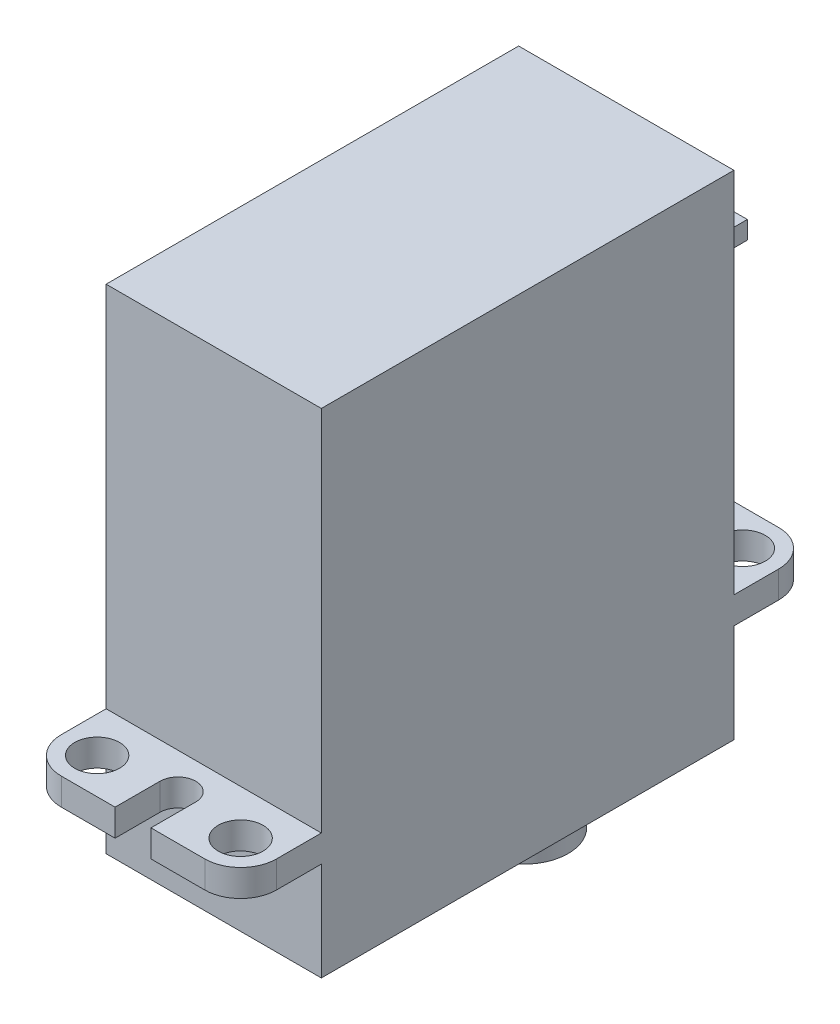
ISO-10303-21;
HEADER;
FILE_DESCRIPTION(('STEP AP214'),'2;1');
FILE_NAME('part.step','',(''),(''),'','','');
FILE_SCHEMA(('AUTOMOTIVE_DESIGN { 1 0 10303 214 1 1 1 1 }'));
ENDSEC;
DATA;
#1=APPLICATION_CONTEXT('core data for automotive mechanical design processes');
#2=APPLICATION_PROTOCOL_DEFINITION('international standard','automotive_design',2000,#1);
#3=PRODUCT_CONTEXT('',#1,'mechanical');
#4=PRODUCT('Part','Part','',(#3));
#5=PRODUCT_RELATED_PRODUCT_CATEGORY('part','',(#4));
#6=PRODUCT_DEFINITION_FORMATION('','',#4);
#7=PRODUCT_DEFINITION_CONTEXT('part definition',#1,'design');
#8=PRODUCT_DEFINITION('design','',#6,#7);
#9=PRODUCT_DEFINITION_SHAPE('','',#8);
#10=(LENGTH_UNIT() NAMED_UNIT(*) SI_UNIT(.MILLI.,.METRE.));
#11=(NAMED_UNIT(*) PLANE_ANGLE_UNIT() SI_UNIT($,.RADIAN.));
#12=(NAMED_UNIT(*) SI_UNIT($,.STERADIAN.) SOLID_ANGLE_UNIT());
#13=UNCERTAINTY_MEASURE_WITH_UNIT(LENGTH_MEASURE(1.E-05),#10,'distance_accuracy_value','');
#14=(GEOMETRIC_REPRESENTATION_CONTEXT(3) GLOBAL_UNCERTAINTY_ASSIGNED_CONTEXT((#13)) GLOBAL_UNIT_ASSIGNED_CONTEXT((#10,
#11,#12)) REPRESENTATION_CONTEXT('',''));
#15=CARTESIAN_POINT('',(0.,0.,0.));
#16=DIRECTION('',(0.,0.,1.));
#17=DIRECTION('',(1.,0.,0.));
#18=AXIS2_PLACEMENT_3D('',#15,#16,#17);
#19=CARTESIAN_POINT('',(0.,0.,5.79));
#20=DIRECTION('',(0.,1.,0.));
#21=DIRECTION('',(1.,0.,0.));
#22=AXIS2_PLACEMENT_3D('',#19,#20,#21);
#23=PLANE('',#22);
#24=CARTESIAN_POINT('',(-4.,0.,19.79));
#25=DIRECTION('',(0.,-1.,0.));
#26=DIRECTION('',(1.,0.,0.));
#27=AXIS2_PLACEMENT_3D('',#24,#25,#26);
#28=CIRCLE('',#27,1.25);
#29=CARTESIAN_POINT('',(-5.25,0.,19.79));
#30=VERTEX_POINT('',#29);
#31=EDGE_CURVE('E585',#30,#30,#28,.T.);
#32=ORIENTED_EDGE('',*,*,#31,.F.);
#33=EDGE_LOOP('',(#32));
#34=FACE_BOUND('',#33,.T.);
#35=CARTESIAN_POINT('',(4.,0.,19.79));
#36=DIRECTION('',(0.,-1.,0.));
#37=DIRECTION('',(1.,0.,0.));
#38=AXIS2_PLACEMENT_3D('',#35,#36,#37);
#39=CIRCLE('',#38,1.25);
#40=CARTESIAN_POINT('',(2.75,0.,19.79));
#41=VERTEX_POINT('',#40);
#42=EDGE_CURVE('E422',#41,#41,#39,.T.);
#43=ORIENTED_EDGE('',*,*,#42,.F.);
#44=EDGE_LOOP('',(#43));
#45=FACE_BOUND('',#44,.T.);
#46=CARTESIAN_POINT('',(-4.,0.,19.79));
#47=DIRECTION('',(0.,1.,0.));
#48=DIRECTION('',(-0.707106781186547,0.,0.707106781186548));
#49=AXIS2_PLACEMENT_3D('',#46,#47,#48);
#50=CIRCLE('',#49,2.);
#51=CARTESIAN_POINT('',(-6.,0.,19.79));
#52=VERTEX_POINT('',#51);
#53=CARTESIAN_POINT('',(-4.,0.,21.79));
#54=VERTEX_POINT('',#53);
#55=EDGE_CURVE('E338',#52,#54,#50,.T.);
#56=ORIENTED_EDGE('',*,*,#55,.F.);
#57=DIRECTION('',(0.,0.,1.));
#58=VECTOR('',#57,1.);
#59=CARTESIAN_POINT('',(-6.,0.,-5.71));
#60=LINE('',#59,#58);
#61=CARTESIAN_POINT('',(-6.,0.,17.29));
#62=VERTEX_POINT('',#61);
#63=EDGE_CURVE('E605',#62,#52,#60,.T.);
#64=ORIENTED_EDGE('',*,*,#63,.F.);
#65=DIRECTION('',(1.,0.,0.));
#66=VECTOR('',#65,1.);
#67=CARTESIAN_POINT('',(3.,0.,17.29));
#68=LINE('',#67,#66);
#69=CARTESIAN_POINT('',(6.,0.,17.29));
#70=VERTEX_POINT('',#69);
#71=EDGE_CURVE('E450',#62,#70,#68,.T.);
#72=ORIENTED_EDGE('',*,*,#71,.T.);
#73=DIRECTION('',(0.,0.,-1.));
#74=VECTOR('',#73,1.);
#75=CARTESIAN_POINT('',(6.,0.,21.79));
#76=LINE('',#75,#74);
#77=CARTESIAN_POINT('',(6.,0.,19.79));
#78=VERTEX_POINT('',#77);
#79=EDGE_CURVE('E402',#78,#70,#76,.T.);
#80=ORIENTED_EDGE('',*,*,#79,.F.);
#81=CARTESIAN_POINT('',(4.,0.,19.79));
#82=DIRECTION('',(0.,1.,0.));
#83=DIRECTION('',(0.707106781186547,0.,0.707106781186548));
#84=AXIS2_PLACEMENT_3D('',#81,#82,#83);
#85=CIRCLE('',#84,2.);
#86=CARTESIAN_POINT('',(4.,0.,21.79));
#87=VERTEX_POINT('',#86);
#88=EDGE_CURVE('E474',#87,#78,#85,.T.);
#89=ORIENTED_EDGE('',*,*,#88,.F.);
#90=DIRECTION('',(-1.,0.,0.));
#91=VECTOR('',#90,1.);
#92=CARTESIAN_POINT('',(6.,0.,21.79));
#93=LINE('',#92,#91);
#94=CARTESIAN_POINT('',(1.,0.,21.79));
#95=VERTEX_POINT('',#94);
#96=EDGE_CURVE('E440',#87,#95,#93,.T.);
#97=ORIENTED_EDGE('',*,*,#96,.T.);
#98=DIRECTION('',(0.,0.,-1.));
#99=VECTOR('',#98,1.);
#100=CARTESIAN_POINT('',(1.,0.,21.79));
#101=LINE('',#100,#99);
#102=CARTESIAN_POINT('',(1.,0.,19.29));
#103=VERTEX_POINT('',#102);
#104=EDGE_CURVE('E565',#95,#103,#101,.T.);
#105=ORIENTED_EDGE('',*,*,#104,.T.);
#106=CARTESIAN_POINT('',(0.,0.,19.29));
#107=DIRECTION('',(0.,1.,0.));
#108=DIRECTION('',(1.,0.,0.));
#109=AXIS2_PLACEMENT_3D('',#106,#107,#108);
#110=CIRCLE('',#109,1.);
#111=CARTESIAN_POINT('',(-1.,0.,19.29));
#112=VERTEX_POINT('',#111);
#113=EDGE_CURVE('E509',#103,#112,#110,.T.);
#114=ORIENTED_EDGE('',*,*,#113,.T.);
#115=DIRECTION('',(0.,0.,-1.));
#116=VECTOR('',#115,1.);
#117=CARTESIAN_POINT('',(-1.,0.,21.79));
#118=LINE('',#117,#116);
#119=CARTESIAN_POINT('',(-1.,0.,21.79));
#120=VERTEX_POINT('',#119);
#121=EDGE_CURVE('E345',#120,#112,#118,.T.);
#122=ORIENTED_EDGE('',*,*,#121,.F.);
#123=DIRECTION('',(-1.,0.,0.));
#124=VECTOR('',#123,1.);
#125=CARTESIAN_POINT('',(6.,0.,21.79));
#126=LINE('',#125,#124);
#127=EDGE_CURVE('E11',#120,#54,#126,.T.);
#128=ORIENTED_EDGE('',*,*,#127,.T.);
#129=EDGE_LOOP('',(#56,#64,#72,#80,#89,#97,#105,#114,#122,#128));
#130=FACE_BOUND('',#129,.T.);
#131=ADVANCED_FACE('F16',(#34,#45,#130),#23,.F.);
#132=CARTESIAN_POINT('',(-6.,0.,21.79));
#133=DIRECTION('',(0.,0.,1.));
#134=DIRECTION('',(1.,0.,0.));
#135=AXIS2_PLACEMENT_3D('',#132,#133,#134);
#136=PLANE('',#135);
#137=DIRECTION('',(0.,1.,0.));
#138=VECTOR('',#137,1.);
#139=CARTESIAN_POINT('',(-4.,0.,21.79));
#140=LINE('',#139,#138);
#141=CARTESIAN_POINT('',(-4.,1.5,21.79));
#142=VERTEX_POINT('',#141);
#143=EDGE_CURVE('E342',#54,#142,#140,.T.);
#144=ORIENTED_EDGE('',*,*,#143,.F.);
#145=ORIENTED_EDGE('',*,*,#127,.F.);
#146=DIRECTION('',(0.,1.,0.));
#147=VECTOR('',#146,1.);
#148=CARTESIAN_POINT('',(-1.,0.,21.79));
#149=LINE('',#148,#147);
#150=CARTESIAN_POINT('',(-1.,1.5,21.79));
#151=VERTEX_POINT('',#150);
#152=EDGE_CURVE('E30',#120,#151,#149,.T.);
#153=ORIENTED_EDGE('',*,*,#152,.T.);
#154=DIRECTION('',(1.,0.,0.));
#155=VECTOR('',#154,1.);
#156=CARTESIAN_POINT('',(6.,1.5,21.79));
#157=LINE('',#156,#155);
#158=EDGE_CURVE('E346',#142,#151,#157,.T.);
#159=ORIENTED_EDGE('',*,*,#158,.F.);
#160=EDGE_LOOP('',(#144,#145,#153,#159));
#161=FACE_BOUND('',#160,.T.);
#162=ADVANCED_FACE('F344',(#161),#136,.T.);
#163=CARTESIAN_POINT('',(-1.,0.,21.79));
#164=DIRECTION('',(1.,0.,0.));
#165=DIRECTION('',(0.,1.,0.));
#166=AXIS2_PLACEMENT_3D('',#163,#164,#165);
#167=PLANE('',#166);
#168=ORIENTED_EDGE('',*,*,#121,.T.);
#169=DIRECTION('',(0.,1.,0.));
#170=VECTOR('',#169,1.);
#171=CARTESIAN_POINT('',(-1.,0.,19.29));
#172=LINE('',#171,#170);
#173=CARTESIAN_POINT('',(-1.,1.5,19.29));
#174=VERTEX_POINT('',#173);
#175=EDGE_CURVE('E398',#112,#174,#172,.T.);
#176=ORIENTED_EDGE('',*,*,#175,.T.);
#177=DIRECTION('',(0.,0.,-1.));
#178=VECTOR('',#177,1.);
#179=CARTESIAN_POINT('',(-1.,1.5,21.79));
#180=LINE('',#179,#178);
#181=EDGE_CURVE('E405',#151,#174,#180,.T.);
#182=ORIENTED_EDGE('',*,*,#181,.F.);
#183=ORIENTED_EDGE('',*,*,#152,.F.);
#184=EDGE_LOOP('',(#168,#176,#182,#183));
#185=FACE_BOUND('',#184,.T.);
#186=ADVANCED_FACE('F903',(#185),#167,.T.);
#187=CARTESIAN_POINT('',(0.,0.,19.29));
#188=DIRECTION('',(0.,1.,0.));
#189=DIRECTION('',(1.,0.,0.));
#190=AXIS2_PLACEMENT_3D('',#187,#188,#189);
#191=CYLINDRICAL_SURFACE('',#190,1.);
#192=ORIENTED_EDGE('',*,*,#113,.F.);
#193=DIRECTION('',(0.,1.,0.));
#194=VECTOR('',#193,1.);
#195=CARTESIAN_POINT('',(1.,0.,19.29));
#196=LINE('',#195,#194);
#197=CARTESIAN_POINT('',(1.,1.5,19.29));
#198=VERTEX_POINT('',#197);
#199=EDGE_CURVE('E513',#103,#198,#196,.T.);
#200=ORIENTED_EDGE('',*,*,#199,.T.);
#201=CARTESIAN_POINT('',(0.,1.5,19.29));
#202=DIRECTION('',(0.,-1.,0.));
#203=DIRECTION('',(1.,0.,0.));
#204=AXIS2_PLACEMENT_3D('',#201,#202,#203);
#205=CIRCLE('',#204,1.);
#206=EDGE_CURVE('E523',#174,#198,#205,.T.);
#207=ORIENTED_EDGE('',*,*,#206,.F.);
#208=ORIENTED_EDGE('',*,*,#175,.F.);
#209=EDGE_LOOP('',(#192,#200,#207,#208));
#210=FACE_BOUND('',#209,.T.);
#211=ADVANCED_FACE('F1181',(#210),#191,.F.);
#212=CARTESIAN_POINT('',(1.,0.,19.29));
#213=DIRECTION('',(-1.,0.,0.));
#214=DIRECTION('',(0.,0.,1.));
#215=AXIS2_PLACEMENT_3D('',#212,#213,#214);
#216=PLANE('',#215);
#217=ORIENTED_EDGE('',*,*,#104,.F.);
#218=DIRECTION('',(0.,1.,0.));
#219=VECTOR('',#218,1.);
#220=CARTESIAN_POINT('',(1.,0.,21.79));
#221=LINE('',#220,#219);
#222=CARTESIAN_POINT('',(1.,1.5,21.79));
#223=VERTEX_POINT('',#222);
#224=EDGE_CURVE('E432',#95,#223,#221,.T.);
#225=ORIENTED_EDGE('',*,*,#224,.T.);
#226=DIRECTION('',(0.,0.,1.));
#227=VECTOR('',#226,1.);
#228=CARTESIAN_POINT('',(1.,1.5,21.79));
#229=LINE('',#228,#227);
#230=EDGE_CURVE('E572',#198,#223,#229,.T.);
#231=ORIENTED_EDGE('',*,*,#230,.F.);
#232=ORIENTED_EDGE('',*,*,#199,.F.);
#233=EDGE_LOOP('',(#217,#225,#231,#232));
#234=FACE_BOUND('',#233,.T.);
#235=ADVANCED_FACE('F870',(#234),#216,.T.);
#236=CARTESIAN_POINT('',(6.,0.,21.79));
#237=DIRECTION('',(1.,0.,0.));
#238=DIRECTION('',(0.,1.,0.));
#239=AXIS2_PLACEMENT_3D('',#236,#237,#238);
#240=PLANE('',#239);
#241=DIRECTION('',(0.,-1.,0.));
#242=VECTOR('',#241,1.);
#243=CARTESIAN_POINT('',(6.,0.,-8.21));
#244=LINE('',#243,#242);
#245=CARTESIAN_POINT('',(6.,1.5,-8.21));
#246=VERTEX_POINT('',#245);
#247=CARTESIAN_POINT('',(6.,0.,-8.21));
#248=VERTEX_POINT('',#247);
#249=EDGE_CURVE('E533',#246,#248,#244,.T.);
#250=ORIENTED_EDGE('',*,*,#249,.F.);
#251=DIRECTION('',(0.,0.,-1.));
#252=VECTOR('',#251,1.);
#253=CARTESIAN_POINT('',(6.,1.5,21.79));
#254=LINE('',#253,#252);
#255=CARTESIAN_POINT('',(6.,1.5,-5.71));
#256=VERTEX_POINT('',#255);
#257=EDGE_CURVE('E393',#256,#246,#254,.T.);
#258=ORIENTED_EDGE('',*,*,#257,.F.);
#259=DIRECTION('',(0.,1.,0.));
#260=VECTOR('',#259,1.);
#261=CARTESIAN_POINT('',(6.,0.,-5.71));
#262=LINE('',#261,#260);
#263=CARTESIAN_POINT('',(6.,22.,-5.71));
#264=VERTEX_POINT('',#263);
#265=EDGE_CURVE('E433',#256,#264,#262,.T.);
#266=ORIENTED_EDGE('',*,*,#265,.T.);
#267=DIRECTION('',(0.,0.,-1.));
#268=VECTOR('',#267,1.);
#269=CARTESIAN_POINT('',(6.,22.,17.29));
#270=LINE('',#269,#268);
#271=CARTESIAN_POINT('',(6.,22.,17.29));
#272=VERTEX_POINT('',#271);
#273=EDGE_CURVE('E496',#272,#264,#270,.T.);
#274=ORIENTED_EDGE('',*,*,#273,.F.);
#275=DIRECTION('',(0.,1.,0.));
#276=VECTOR('',#275,1.);
#277=CARTESIAN_POINT('',(6.,0.,17.29));
#278=LINE('',#277,#276);
#279=CARTESIAN_POINT('',(6.,1.5,17.29));
#280=VERTEX_POINT('',#279);
#281=EDGE_CURVE('E395',#280,#272,#278,.T.);
#282=ORIENTED_EDGE('',*,*,#281,.F.);
#283=DIRECTION('',(0.,0.,-1.));
#284=VECTOR('',#283,1.);
#285=CARTESIAN_POINT('',(6.,1.5,21.79));
#286=LINE('',#285,#284);
#287=CARTESIAN_POINT('',(6.,1.5,19.79));
#288=VERTEX_POINT('',#287);
#289=EDGE_CURVE('E374',#288,#280,#286,.T.);
#290=ORIENTED_EDGE('',*,*,#289,.F.);
#291=DIRECTION('',(0.,1.,0.));
#292=VECTOR('',#291,1.);
#293=CARTESIAN_POINT('',(6.,0.,19.79));
#294=LINE('',#293,#292);
#295=EDGE_CURVE('E437',#78,#288,#294,.T.);
#296=ORIENTED_EDGE('',*,*,#295,.F.);
#297=ORIENTED_EDGE('',*,*,#79,.T.);
#298=DIRECTION('',(0.,1.,0.));
#299=VECTOR('',#298,1.);
#300=CARTESIAN_POINT('',(6.,0.,17.29));
#301=LINE('',#300,#299);
#302=CARTESIAN_POINT('',(6.,-5.5,17.29));
#303=VERTEX_POINT('',#302);
#304=EDGE_CURVE('E677',#303,#70,#301,.T.);
#305=ORIENTED_EDGE('',*,*,#304,.F.);
#306=DIRECTION('',(0.,0.,1.));
#307=VECTOR('',#306,1.);
#308=CARTESIAN_POINT('',(6.,-5.5,17.29));
#309=LINE('',#308,#307);
#310=CARTESIAN_POINT('',(6.,-5.5,-5.71));
#311=VERTEX_POINT('',#310);
#312=EDGE_CURVE('E391',#311,#303,#309,.T.);
#313=ORIENTED_EDGE('',*,*,#312,.F.);
#314=DIRECTION('',(0.,1.,0.));
#315=VECTOR('',#314,1.);
#316=CARTESIAN_POINT('',(6.,0.,-5.71));
#317=LINE('',#316,#315);
#318=CARTESIAN_POINT('',(6.,0.,-5.71));
#319=VERTEX_POINT('',#318);
#320=EDGE_CURVE('E617',#311,#319,#317,.T.);
#321=ORIENTED_EDGE('',*,*,#320,.T.);
#322=DIRECTION('',(0.,0.,-1.));
#323=VECTOR('',#322,1.);
#324=CARTESIAN_POINT('',(6.,0.,21.79));
#325=LINE('',#324,#323);
#326=EDGE_CURVE('E632',#319,#248,#325,.T.);
#327=ORIENTED_EDGE('',*,*,#326,.T.);
#328=EDGE_LOOP('',(#250,#258,#266,#274,#282,#290,#296,#297,#305,#313,#321,#327));
#329=FACE_BOUND('',#328,.T.);
#330=ADVANCED_FACE('F865',(#329),#240,.T.);
#331=CARTESIAN_POINT('',(1.,0.,-10.21));
#332=DIRECTION('',(-1.,0.,0.));
#333=DIRECTION('',(0.,0.,1.));
#334=AXIS2_PLACEMENT_3D('',#331,#332,#333);
#335=PLANE('',#334);
#336=DIRECTION('',(0.,0.,1.));
#337=VECTOR('',#336,1.);
#338=CARTESIAN_POINT('',(1.,0.,-10.21));
#339=LINE('',#338,#337);
#340=CARTESIAN_POINT('',(1.,0.,-10.21));
#341=VERTEX_POINT('',#340);
#342=CARTESIAN_POINT('',(1.,0.,-7.71));
#343=VERTEX_POINT('',#342);
#344=EDGE_CURVE('E506',#341,#343,#339,.T.);
#345=ORIENTED_EDGE('',*,*,#344,.T.);
#346=DIRECTION('',(0.,1.,0.));
#347=VECTOR('',#346,1.);
#348=CARTESIAN_POINT('',(1.,0.,-7.71));
#349=LINE('',#348,#347);
#350=CARTESIAN_POINT('',(1.,1.5,-7.71));
#351=VERTEX_POINT('',#350);
#352=EDGE_CURVE('E401',#343,#351,#349,.T.);
#353=ORIENTED_EDGE('',*,*,#352,.T.);
#354=DIRECTION('',(0.,0.,1.));
#355=VECTOR('',#354,1.);
#356=CARTESIAN_POINT('',(1.,1.5,-10.21));
#357=LINE('',#356,#355);
#358=CARTESIAN_POINT('',(1.,1.5,-10.21));
#359=VERTEX_POINT('',#358);
#360=EDGE_CURVE('E624',#359,#351,#357,.T.);
#361=ORIENTED_EDGE('',*,*,#360,.F.);
#362=DIRECTION('',(0.,1.,0.));
#363=VECTOR('',#362,1.);
#364=CARTESIAN_POINT('',(1.,0.,-10.21));
#365=LINE('',#364,#363);
#366=EDGE_CURVE('E306',#341,#359,#365,.T.);
#367=ORIENTED_EDGE('',*,*,#366,.F.);
#368=EDGE_LOOP('',(#345,#353,#361,#367));
#369=FACE_BOUND('',#368,.T.);
#370=ADVANCED_FACE('F866',(#369),#335,.T.);
#371=CARTESIAN_POINT('',(0.,0.,-7.71));
#372=DIRECTION('',(0.,1.,0.));
#373=DIRECTION('',(1.,0.,0.));
#374=AXIS2_PLACEMENT_3D('',#371,#372,#373);
#375=CYLINDRICAL_SURFACE('',#374,1.);
#376=CARTESIAN_POINT('',(0.,0.,-7.71));
#377=DIRECTION('',(0.,1.,0.));
#378=DIRECTION('',(1.,0.,0.));
#379=AXIS2_PLACEMENT_3D('',#376,#377,#378);
#380=CIRCLE('',#379,1.);
#381=CARTESIAN_POINT('',(-1.,0.,-7.71));
#382=VERTEX_POINT('',#381);
#383=EDGE_CURVE('E502',#382,#343,#380,.T.);
#384=ORIENTED_EDGE('',*,*,#383,.F.);
#385=DIRECTION('',(0.,1.,0.));
#386=VECTOR('',#385,1.);
#387=CARTESIAN_POINT('',(-1.,0.,-7.71));
#388=LINE('',#387,#386);
#389=CARTESIAN_POINT('',(-1.,1.5,-7.71));
#390=VERTEX_POINT('',#389);
#391=EDGE_CURVE('E404',#382,#390,#388,.T.);
#392=ORIENTED_EDGE('',*,*,#391,.T.);
#393=CARTESIAN_POINT('',(0.,1.5,-7.71));
#394=DIRECTION('',(0.,-1.,0.));
#395=DIRECTION('',(1.,0.,0.));
#396=AXIS2_PLACEMENT_3D('',#393,#394,#395);
#397=CIRCLE('',#396,1.);
#398=EDGE_CURVE('E619',#351,#390,#397,.T.);
#399=ORIENTED_EDGE('',*,*,#398,.F.);
#400=ORIENTED_EDGE('',*,*,#352,.F.);
#401=EDGE_LOOP('',(#384,#392,#399,#400));
#402=FACE_BOUND('',#401,.T.);
#403=ADVANCED_FACE('F1353',(#402),#375,.F.);
#404=CARTESIAN_POINT('',(-1.,0.,-7.71));
#405=DIRECTION('',(1.,0.,0.));
#406=DIRECTION('',(0.,0.,1.));
#407=AXIS2_PLACEMENT_3D('',#404,#405,#406);
#408=PLANE('',#407);
#409=DIRECTION('',(0.,0.,1.));
#410=VECTOR('',#409,1.);
#411=CARTESIAN_POINT('',(-1.,0.,-10.21));
#412=LINE('',#411,#410);
#413=CARTESIAN_POINT('',(-1.,0.,-10.21));
#414=VERTEX_POINT('',#413);
#415=EDGE_CURVE('E510',#414,#382,#412,.T.);
#416=ORIENTED_EDGE('',*,*,#415,.F.);
#417=DIRECTION('',(0.,1.,0.));
#418=VECTOR('',#417,1.);
#419=CARTESIAN_POINT('',(-1.,0.,-10.21));
#420=LINE('',#419,#418);
#421=CARTESIAN_POINT('',(-1.,1.5,-10.21));
#422=VERTEX_POINT('',#421);
#423=EDGE_CURVE('E541',#414,#422,#420,.T.);
#424=ORIENTED_EDGE('',*,*,#423,.T.);
#425=DIRECTION('',(0.,0.,-1.));
#426=VECTOR('',#425,1.);
#427=CARTESIAN_POINT('',(-1.,1.5,-10.21));
#428=LINE('',#427,#426);
#429=EDGE_CURVE('E622',#390,#422,#428,.T.);
#430=ORIENTED_EDGE('',*,*,#429,.F.);
#431=ORIENTED_EDGE('',*,*,#391,.F.);
#432=EDGE_LOOP('',(#416,#424,#430,#431));
#433=FACE_BOUND('',#432,.T.);
#434=ADVANCED_FACE('F934',(#433),#408,.T.);
#435=CARTESIAN_POINT('',(-1.,0.,-10.21));
#436=DIRECTION('',(0.,0.,-1.));
#437=DIRECTION('',(0.,-1.,0.));
#438=AXIS2_PLACEMENT_3D('',#435,#436,#437);
#439=PLANE('',#438);
#440=DIRECTION('',(0.,-1.,0.));
#441=VECTOR('',#440,1.);
#442=CARTESIAN_POINT('',(-4.,0.,-10.21));
#443=LINE('',#442,#441);
#444=CARTESIAN_POINT('',(-4.,1.5,-10.21));
#445=VERTEX_POINT('',#444);
#446=CARTESIAN_POINT('',(-4.,0.,-10.21));
#447=VERTEX_POINT('',#446);
#448=EDGE_CURVE('E420',#445,#447,#443,.T.);
#449=ORIENTED_EDGE('',*,*,#448,.F.);
#450=DIRECTION('',(-1.,0.,0.));
#451=VECTOR('',#450,1.);
#452=CARTESIAN_POINT('',(-6.,1.5,-10.21));
#453=LINE('',#452,#451);
#454=EDGE_CURVE('E580',#422,#445,#453,.T.);
#455=ORIENTED_EDGE('',*,*,#454,.F.);
#456=ORIENTED_EDGE('',*,*,#423,.F.);
#457=DIRECTION('',(1.,0.,0.));
#458=VECTOR('',#457,1.);
#459=CARTESIAN_POINT('',(-6.,0.,-10.21));
#460=LINE('',#459,#458);
#461=EDGE_CURVE('E552',#447,#414,#460,.T.);
#462=ORIENTED_EDGE('',*,*,#461,.F.);
#463=EDGE_LOOP('',(#449,#455,#456,#462));
#464=FACE_BOUND('',#463,.T.);
#465=ADVANCED_FACE('F931',(#464),#439,.T.);
#466=CARTESIAN_POINT('',(4.,0.,-8.21));
#467=DIRECTION('',(0.,1.,0.));
#468=DIRECTION('',(1.,0.,0.));
#469=AXIS2_PLACEMENT_3D('',#466,#467,#468);
#470=CYLINDRICAL_SURFACE('',#469,1.25);
#471=CARTESIAN_POINT('',(4.,1.5,-8.21));
#472=DIRECTION('',(0.,-1.,0.));
#473=DIRECTION('',(1.,0.,0.));
#474=AXIS2_PLACEMENT_3D('',#471,#472,#473);
#475=CIRCLE('',#474,1.25);
#476=CARTESIAN_POINT('',(2.75,1.5,-8.21));
#477=VERTEX_POINT('',#476);
#478=EDGE_CURVE('E499',#477,#477,#475,.T.);
#479=ORIENTED_EDGE('',*,*,#478,.F.);
#480=DIRECTION('',(0.,-1.,0.));
#481=VECTOR('',#480,1.);
#482=CARTESIAN_POINT('',(2.75,0.,-8.21));
#483=LINE('',#482,#481);
#484=CARTESIAN_POINT('',(2.75,0.,-8.21));
#485=VERTEX_POINT('',#484);
#486=EDGE_CURVE('E428',#477,#485,#483,.T.);
#487=ORIENTED_EDGE('',*,*,#486,.T.);
#488=CARTESIAN_POINT('',(4.,0.,-8.21));
#489=DIRECTION('',(0.,-1.,0.));
#490=DIRECTION('',(1.,0.,0.));
#491=AXIS2_PLACEMENT_3D('',#488,#489,#490);
#492=CIRCLE('',#491,1.25);
#493=EDGE_CURVE('E410',#485,#485,#492,.T.);
#494=ORIENTED_EDGE('',*,*,#493,.T.);
#495=ORIENTED_EDGE('',*,*,#486,.F.);
#496=EDGE_LOOP('',(#479,#487,#494,#495));
#497=FACE_BOUND('',#496,.T.);
#498=ADVANCED_FACE('F933',(#497),#470,.F.);
#499=CARTESIAN_POINT('',(4.,0.,19.79));
#500=DIRECTION('',(0.,1.,0.));
#501=DIRECTION('',(1.,0.,0.));
#502=AXIS2_PLACEMENT_3D('',#499,#500,#501);
#503=CYLINDRICAL_SURFACE('',#502,1.25);
#504=CARTESIAN_POINT('',(4.,1.5,19.79));
#505=DIRECTION('',(0.,-1.,0.));
#506=DIRECTION('',(1.,0.,0.));
#507=AXIS2_PLACEMENT_3D('',#504,#505,#506);
#508=CIRCLE('',#507,1.25);
#509=CARTESIAN_POINT('',(2.75,1.5,19.79));
#510=VERTEX_POINT('',#509);
#511=EDGE_CURVE('E369',#510,#510,#508,.T.);
#512=ORIENTED_EDGE('',*,*,#511,.F.);
#513=DIRECTION('',(0.,-1.,0.));
#514=VECTOR('',#513,1.);
#515=CARTESIAN_POINT('',(2.75,0.,19.79));
#516=LINE('',#515,#514);
#517=EDGE_CURVE('E427',#510,#41,#516,.T.);
#518=ORIENTED_EDGE('',*,*,#517,.T.);
#519=ORIENTED_EDGE('',*,*,#42,.T.);
#520=ORIENTED_EDGE('',*,*,#517,.F.);
#521=EDGE_LOOP('',(#512,#518,#519,#520));
#522=FACE_BOUND('',#521,.T.);
#523=ADVANCED_FACE('F894',(#522),#503,.F.);
#524=CARTESIAN_POINT('',(-4.,0.,19.79));
#525=DIRECTION('',(0.,1.,0.));
#526=DIRECTION('',(1.,0.,0.));
#527=AXIS2_PLACEMENT_3D('',#524,#525,#526);
#528=CYLINDRICAL_SURFACE('',#527,1.25);
#529=CARTESIAN_POINT('',(-4.,1.5,19.79));
#530=DIRECTION('',(0.,-1.,0.));
#531=DIRECTION('',(1.,0.,0.));
#532=AXIS2_PLACEMENT_3D('',#529,#530,#531);
#533=CIRCLE('',#532,1.25);
#534=CARTESIAN_POINT('',(-5.25,1.5,19.79));
#535=VERTEX_POINT('',#534);
#536=EDGE_CURVE('E388',#535,#535,#533,.T.);
#537=ORIENTED_EDGE('',*,*,#536,.F.);
#538=DIRECTION('',(0.,-1.,0.));
#539=VECTOR('',#538,1.);
#540=CARTESIAN_POINT('',(-5.25,0.,19.79));
#541=LINE('',#540,#539);
#542=EDGE_CURVE('E20',#535,#30,#541,.T.);
#543=ORIENTED_EDGE('',*,*,#542,.T.);
#544=ORIENTED_EDGE('',*,*,#31,.T.);
#545=ORIENTED_EDGE('',*,*,#542,.F.);
#546=EDGE_LOOP('',(#537,#543,#544,#545));
#547=FACE_BOUND('',#546,.T.);
#548=ADVANCED_FACE('F886',(#547),#528,.F.);
#549=CARTESIAN_POINT('',(-4.,0.,-8.21));
#550=DIRECTION('',(0.,1.,0.));
#551=DIRECTION('',(1.,0.,0.));
#552=AXIS2_PLACEMENT_3D('',#549,#550,#551);
#553=CYLINDRICAL_SURFACE('',#552,1.25);
#554=CARTESIAN_POINT('',(-4.,1.5,-8.21));
#555=DIRECTION('',(0.,-1.,0.));
#556=DIRECTION('',(1.,0.,0.));
#557=AXIS2_PLACEMENT_3D('',#554,#555,#556);
#558=CIRCLE('',#557,1.25);
#559=CARTESIAN_POINT('',(-5.25,1.5,-8.21));
#560=VERTEX_POINT('',#559);
#561=EDGE_CURVE('E492',#560,#560,#558,.T.);
#562=ORIENTED_EDGE('',*,*,#561,.F.);
#563=DIRECTION('',(0.,-1.,0.));
#564=VECTOR('',#563,1.);
#565=CARTESIAN_POINT('',(-5.25,0.,-8.21));
#566=LINE('',#565,#564);
#567=CARTESIAN_POINT('',(-5.25,0.,-8.21));
#568=VERTEX_POINT('',#567);
#569=EDGE_CURVE('E500',#560,#568,#566,.T.);
#570=ORIENTED_EDGE('',*,*,#569,.T.);
#571=CARTESIAN_POINT('',(-4.,0.,-8.21));
#572=DIRECTION('',(0.,-1.,0.));
#573=DIRECTION('',(1.,0.,0.));
#574=AXIS2_PLACEMENT_3D('',#571,#572,#573);
#575=CIRCLE('',#574,1.25);
#576=EDGE_CURVE('E411',#568,#568,#575,.T.);
#577=ORIENTED_EDGE('',*,*,#576,.T.);
#578=ORIENTED_EDGE('',*,*,#569,.F.);
#579=EDGE_LOOP('',(#562,#570,#577,#578));
#580=FACE_BOUND('',#579,.T.);
#581=ADVANCED_FACE('F885',(#580),#553,.F.);
#582=CARTESIAN_POINT('',(0.,1.5,5.79));
#583=DIRECTION('',(0.,1.,0.));
#584=DIRECTION('',(1.,0.,0.));
#585=AXIS2_PLACEMENT_3D('',#582,#583,#584);
#586=PLANE('',#585);
#587=ORIENTED_EDGE('',*,*,#561,.T.);
#588=EDGE_LOOP('',(#587));
#589=FACE_BOUND('',#588,.T.);
#590=ORIENTED_EDGE('',*,*,#478,.T.);
#591=EDGE_LOOP('',(#590));
#592=FACE_BOUND('',#591,.T.);
#593=CARTESIAN_POINT('',(-4.,1.5,-8.21));
#594=DIRECTION('',(0.,-1.,0.));
#595=DIRECTION('',(-0.707106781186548,0.,-0.707106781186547));
#596=AXIS2_PLACEMENT_3D('',#593,#594,#595);
#597=CIRCLE('',#596,2.);
#598=CARTESIAN_POINT('',(-6.,1.5,-8.21));
#599=VERTEX_POINT('',#598);
#600=EDGE_CURVE('E424',#599,#445,#597,.T.);
#601=ORIENTED_EDGE('',*,*,#600,.F.);
#602=DIRECTION('',(0.,0.,1.));
#603=VECTOR('',#602,1.);
#604=CARTESIAN_POINT('',(-6.,1.5,-5.71));
#605=LINE('',#604,#603);
#606=CARTESIAN_POINT('',(-6.,1.5,-5.71));
#607=VERTEX_POINT('',#606);
#608=EDGE_CURVE('E548',#599,#607,#605,.T.);
#609=ORIENTED_EDGE('',*,*,#608,.T.);
#610=DIRECTION('',(1.,0.,0.));
#611=VECTOR('',#610,1.);
#612=CARTESIAN_POINT('',(-3.,1.5,-5.71));
#613=LINE('',#612,#611);
#614=EDGE_CURVE('E512',#607,#256,#613,.T.);
#615=ORIENTED_EDGE('',*,*,#614,.T.);
#616=ORIENTED_EDGE('',*,*,#257,.T.);
#617=CARTESIAN_POINT('',(4.,1.5,-8.21));
#618=DIRECTION('',(0.,-1.,0.));
#619=DIRECTION('',(0.707106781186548,0.,-0.707106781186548));
#620=AXIS2_PLACEMENT_3D('',#617,#618,#619);
#621=CIRCLE('',#620,2.);
#622=CARTESIAN_POINT('',(4.,1.5,-10.21));
#623=VERTEX_POINT('',#622);
#624=EDGE_CURVE('E534',#623,#246,#621,.T.);
#625=ORIENTED_EDGE('',*,*,#624,.F.);
#626=DIRECTION('',(-1.,0.,0.));
#627=VECTOR('',#626,1.);
#628=CARTESIAN_POINT('',(-6.,1.5,-10.21));
#629=LINE('',#628,#627);
#630=EDGE_CURVE('E364',#623,#359,#629,.T.);
#631=ORIENTED_EDGE('',*,*,#630,.T.);
#632=ORIENTED_EDGE('',*,*,#360,.T.);
#633=ORIENTED_EDGE('',*,*,#398,.T.);
#634=ORIENTED_EDGE('',*,*,#429,.T.);
#635=ORIENTED_EDGE('',*,*,#454,.T.);
#636=EDGE_LOOP('',(#601,#609,#615,#616,#625,#631,#632,#633,#634,#635));
#637=FACE_BOUND('',#636,.T.);
#638=ADVANCED_FACE('F813',(#589,#592,#637),#586,.T.);
#639=CARTESIAN_POINT('',(0.,-5.5,5.79));
#640=DIRECTION('',(0.,1.,0.));
#641=DIRECTION('',(1.,0.,0.));
#642=AXIS2_PLACEMENT_3D('',#639,#640,#641);
#643=PLANE('',#642);
#644=CARTESIAN_POINT('',(0.,-5.5,0.));
#645=DIRECTION('',(0.,1.,0.));
#646=DIRECTION('',(1.,0.,0.));
#647=AXIS2_PLACEMENT_3D('',#644,#645,#646);
#648=CIRCLE('',#647,4.5);
#649=CARTESIAN_POINT('',(-4.5,-5.5,0.));
#650=VERTEX_POINT('',#649);
#651=EDGE_CURVE('E454',#650,#650,#648,.T.);
#652=ORIENTED_EDGE('',*,*,#651,.T.);
#653=EDGE_LOOP('',(#652));
#654=FACE_BOUND('',#653,.T.);
#655=DIRECTION('',(0.,0.,-1.));
#656=VECTOR('',#655,1.);
#657=CARTESIAN_POINT('',(-6.,-5.5,-5.71));
#658=LINE('',#657,#656);
#659=CARTESIAN_POINT('',(-6.,-5.5,17.29));
#660=VERTEX_POINT('',#659);
#661=CARTESIAN_POINT('',(-6.,-5.5,-5.71));
#662=VERTEX_POINT('',#661);
#663=EDGE_CURVE('E417',#660,#662,#658,.T.);
#664=ORIENTED_EDGE('',*,*,#663,.T.);
#665=DIRECTION('',(1.,0.,0.));
#666=VECTOR('',#665,1.);
#667=CARTESIAN_POINT('',(6.,-5.5,-5.71));
#668=LINE('',#667,#666);
#669=EDGE_CURVE('E615',#662,#311,#668,.T.);
#670=ORIENTED_EDGE('',*,*,#669,.T.);
#671=ORIENTED_EDGE('',*,*,#312,.T.);
#672=DIRECTION('',(-1.,0.,0.));
#673=VECTOR('',#672,1.);
#674=CARTESIAN_POINT('',(-6.,-5.5,17.29));
#675=LINE('',#674,#673);
#676=EDGE_CURVE('E529',#303,#660,#675,.T.);
#677=ORIENTED_EDGE('',*,*,#676,.T.);
#678=EDGE_LOOP('',(#664,#670,#671,#677));
#679=FACE_BOUND('',#678,.T.);
#680=ADVANCED_FACE('F852',(#654,#679),#643,.F.);
#681=CARTESIAN_POINT('',(6.,0.,17.29));
#682=DIRECTION('',(0.,0.,1.));
#683=DIRECTION('',(1.,0.,0.));
#684=AXIS2_PLACEMENT_3D('',#681,#682,#683);
#685=PLANE('',#684);
#686=DIRECTION('',(-1.,0.,0.));
#687=VECTOR('',#686,1.);
#688=CARTESIAN_POINT('',(3.,1.5,17.29));
#689=LINE('',#688,#687);
#690=CARTESIAN_POINT('',(-6.,1.5,17.29));
#691=VERTEX_POINT('',#690);
#692=EDGE_CURVE('E390',#280,#691,#689,.T.);
#693=ORIENTED_EDGE('',*,*,#692,.F.);
#694=ORIENTED_EDGE('',*,*,#281,.T.);
#695=DIRECTION('',(1.,0.,0.));
#696=VECTOR('',#695,1.);
#697=CARTESIAN_POINT('',(-6.,22.,17.29));
#698=LINE('',#697,#696);
#699=CARTESIAN_POINT('',(-6.,22.,17.29));
#700=VERTEX_POINT('',#699);
#701=EDGE_CURVE('E501',#700,#272,#698,.T.);
#702=ORIENTED_EDGE('',*,*,#701,.F.);
#703=DIRECTION('',(0.,1.,0.));
#704=VECTOR('',#703,1.);
#705=CARTESIAN_POINT('',(-6.,0.,17.29));
#706=LINE('',#705,#704);
#707=EDGE_CURVE('E549',#691,#700,#706,.T.);
#708=ORIENTED_EDGE('',*,*,#707,.F.);
#709=EDGE_LOOP('',(#693,#694,#702,#708));
#710=FACE_BOUND('',#709,.T.);
#711=ADVANCED_FACE('F848',(#710),#685,.T.);
#712=CARTESIAN_POINT('',(0.,22.,5.79));
#713=DIRECTION('',(0.,1.,0.));
#714=DIRECTION('',(1.,0.,0.));
#715=AXIS2_PLACEMENT_3D('',#712,#713,#714);
#716=PLANE('',#715);
#717=DIRECTION('',(0.,0.,1.));
#718=VECTOR('',#717,1.);
#719=CARTESIAN_POINT('',(-6.,22.,-5.71));
#720=LINE('',#719,#718);
#721=CARTESIAN_POINT('',(-6.,22.,-5.71));
#722=VERTEX_POINT('',#721);
#723=EDGE_CURVE('E544',#722,#700,#720,.T.);
#724=ORIENTED_EDGE('',*,*,#723,.T.);
#725=ORIENTED_EDGE('',*,*,#701,.T.);
#726=ORIENTED_EDGE('',*,*,#273,.T.);
#727=DIRECTION('',(-1.,0.,0.));
#728=VECTOR('',#727,1.);
#729=CARTESIAN_POINT('',(6.,22.,-5.71));
#730=LINE('',#729,#728);
#731=EDGE_CURVE('E607',#264,#722,#730,.T.);
#732=ORIENTED_EDGE('',*,*,#731,.T.);
#733=EDGE_LOOP('',(#724,#725,#726,#732));
#734=FACE_BOUND('',#733,.T.);
#735=ADVANCED_FACE('F853',(#734),#716,.T.);
#736=CARTESIAN_POINT('',(-6.,0.,-5.71));
#737=DIRECTION('',(0.,0.,-1.));
#738=DIRECTION('',(0.,-1.,0.));
#739=AXIS2_PLACEMENT_3D('',#736,#737,#738);
#740=PLANE('',#739);
#741=DIRECTION('',(-1.,0.,0.));
#742=VECTOR('',#741,1.);
#743=CARTESIAN_POINT('',(-3.,0.,-5.71));
#744=LINE('',#743,#742);
#745=CARTESIAN_POINT('',(-6.,0.,-5.71));
#746=VERTEX_POINT('',#745);
#747=EDGE_CURVE('E415',#319,#746,#744,.T.);
#748=ORIENTED_EDGE('',*,*,#747,.F.);
#749=ORIENTED_EDGE('',*,*,#320,.F.);
#750=ORIENTED_EDGE('',*,*,#669,.F.);
#751=DIRECTION('',(0.,-1.,0.));
#752=VECTOR('',#751,1.);
#753=CARTESIAN_POINT('',(-6.,0.,-5.71));
#754=LINE('',#753,#752);
#755=EDGE_CURVE('E413',#746,#662,#754,.T.);
#756=ORIENTED_EDGE('',*,*,#755,.F.);
#757=EDGE_LOOP('',(#748,#749,#750,#756));
#758=FACE_BOUND('',#757,.T.);
#759=ADVANCED_FACE('F909',(#758),#740,.T.);
#760=CARTESIAN_POINT('',(6.,0.,17.29));
#761=DIRECTION('',(0.,0.,1.));
#762=DIRECTION('',(1.,0.,0.));
#763=AXIS2_PLACEMENT_3D('',#760,#761,#762);
#764=PLANE('',#763);
#765=ORIENTED_EDGE('',*,*,#71,.F.);
#766=DIRECTION('',(0.,1.,0.));
#767=VECTOR('',#766,1.);
#768=CARTESIAN_POINT('',(-6.,0.,17.29));
#769=LINE('',#768,#767);
#770=EDGE_CURVE('E598',#660,#62,#769,.T.);
#771=ORIENTED_EDGE('',*,*,#770,.F.);
#772=ORIENTED_EDGE('',*,*,#676,.F.);
#773=ORIENTED_EDGE('',*,*,#304,.T.);
#774=EDGE_LOOP('',(#765,#771,#772,#773));
#775=FACE_BOUND('',#774,.T.);
#776=ADVANCED_FACE('F18',(#775),#764,.T.);
#777=CARTESIAN_POINT('',(0.,-9.9,0.));
#778=DIRECTION('',(0.,1.,0.));
#779=DIRECTION('',(1.,0.,0.));
#780=AXIS2_PLACEMENT_3D('',#777,#778,#779);
#781=PLANE('',#780);
#782=CARTESIAN_POINT('',(0.,-9.9,0.));
#783=DIRECTION('',(0.,-1.,0.));
#784=DIRECTION('',(1.,0.,0.));
#785=AXIS2_PLACEMENT_3D('',#782,#783,#784);
#786=CIRCLE('',#785,2.475);
#787=CARTESIAN_POINT('',(-2.475,-9.9,0.));
#788=VERTEX_POINT('',#787);
#789=EDGE_CURVE('E444',#788,#788,#786,.T.);
#790=ORIENTED_EDGE('',*,*,#789,.T.);
#791=EDGE_LOOP('',(#790));
#792=FACE_BOUND('',#791,.T.);
#793=ADVANCED_FACE('F917',(#792),#781,.F.);
#794=CARTESIAN_POINT('',(0.,0.,0.));
#795=DIRECTION('',(0.,-1.,0.));
#796=DIRECTION('',(1.,0.,0.));
#797=AXIS2_PLACEMENT_3D('',#794,#795,#796);
#798=CYLINDRICAL_SURFACE('',#797,2.475);
#799=ORIENTED_EDGE('',*,*,#789,.F.);
#800=DIRECTION('',(0.,1.,0.));
#801=VECTOR('',#800,1.);
#802=CARTESIAN_POINT('',(-2.475,0.,0.));
#803=LINE('',#802,#801);
#804=CARTESIAN_POINT('',(-2.475,-6.5,0.));
#805=VERTEX_POINT('',#804);
#806=EDGE_CURVE('E447',#788,#805,#803,.T.);
#807=ORIENTED_EDGE('',*,*,#806,.T.);
#808=CARTESIAN_POINT('',(0.,-6.5,0.));
#809=DIRECTION('',(0.,-1.,0.));
#810=DIRECTION('',(1.,0.,0.));
#811=AXIS2_PLACEMENT_3D('',#808,#809,#810);
#812=CIRCLE('',#811,2.475);
#813=EDGE_CURVE('E451',#805,#805,#812,.T.);
#814=ORIENTED_EDGE('',*,*,#813,.T.);
#815=ORIENTED_EDGE('',*,*,#806,.F.);
#816=EDGE_LOOP('',(#799,#807,#814,#815));
#817=FACE_BOUND('',#816,.T.);
#818=ADVANCED_FACE('F1228',(#817),#798,.T.);
#819=CARTESIAN_POINT('',(1.,0.,21.79));
#820=DIRECTION('',(0.,0.,1.));
#821=DIRECTION('',(1.,0.,0.));
#822=AXIS2_PLACEMENT_3D('',#819,#820,#821);
#823=PLANE('',#822);
#824=DIRECTION('',(0.,-1.,0.));
#825=VECTOR('',#824,1.);
#826=CARTESIAN_POINT('',(4.,0.,21.79));
#827=LINE('',#826,#825);
#828=CARTESIAN_POINT('',(4.,1.5,21.79));
#829=VERTEX_POINT('',#828);
#830=EDGE_CURVE('E466',#829,#87,#827,.T.);
#831=ORIENTED_EDGE('',*,*,#830,.F.);
#832=DIRECTION('',(1.,0.,0.));
#833=VECTOR('',#832,1.);
#834=CARTESIAN_POINT('',(6.,1.5,21.79));
#835=LINE('',#834,#833);
#836=EDGE_CURVE('E376',#223,#829,#835,.T.);
#837=ORIENTED_EDGE('',*,*,#836,.F.);
#838=ORIENTED_EDGE('',*,*,#224,.F.);
#839=ORIENTED_EDGE('',*,*,#96,.F.);
#840=EDGE_LOOP('',(#831,#837,#838,#839));
#841=FACE_BOUND('',#840,.T.);
#842=ADVANCED_FACE('F1212',(#841),#823,.T.);
#843=CARTESIAN_POINT('',(4.,0.,19.79));
#844=DIRECTION('',(0.,1.,0.));
#845=DIRECTION('',(0.707106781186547,0.,0.707106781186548));
#846=AXIS2_PLACEMENT_3D('',#843,#844,#845);
#847=CYLINDRICAL_SURFACE('',#846,2.);
#848=CARTESIAN_POINT('',(4.,1.5,19.79));
#849=DIRECTION('',(0.,-1.,0.));
#850=DIRECTION('',(0.707106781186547,0.,0.707106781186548));
#851=AXIS2_PLACEMENT_3D('',#848,#849,#850);
#852=CIRCLE('',#851,2.);
#853=EDGE_CURVE('E371',#288,#829,#852,.T.);
#854=ORIENTED_EDGE('',*,*,#853,.T.);
#855=ORIENTED_EDGE('',*,*,#830,.T.);
#856=ORIENTED_EDGE('',*,*,#88,.T.);
#857=ORIENTED_EDGE('',*,*,#295,.T.);
#858=EDGE_LOOP('',(#854,#855,#856,#857));
#859=FACE_BOUND('',#858,.T.);
#860=ADVANCED_FACE('F1138',(#859),#847,.T.);
#861=CARTESIAN_POINT('',(0.,1.5,5.79));
#862=DIRECTION('',(0.,1.,0.));
#863=DIRECTION('',(1.,0.,0.));
#864=AXIS2_PLACEMENT_3D('',#861,#862,#863);
#865=PLANE('',#864);
#866=ORIENTED_EDGE('',*,*,#511,.T.);
#867=EDGE_LOOP('',(#866));
#868=FACE_BOUND('',#867,.T.);
#869=ORIENTED_EDGE('',*,*,#536,.T.);
#870=EDGE_LOOP('',(#869));
#871=FACE_BOUND('',#870,.T.);
#872=CARTESIAN_POINT('',(-4.,1.5,19.79));
#873=DIRECTION('',(0.,-1.,0.));
#874=DIRECTION('',(-0.707106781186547,0.,0.707106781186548));
#875=AXIS2_PLACEMENT_3D('',#872,#873,#874);
#876=CIRCLE('',#875,2.);
#877=CARTESIAN_POINT('',(-6.,1.5,19.79));
#878=VERTEX_POINT('',#877);
#879=EDGE_CURVE('E360',#142,#878,#876,.T.);
#880=ORIENTED_EDGE('',*,*,#879,.F.);
#881=ORIENTED_EDGE('',*,*,#158,.T.);
#882=ORIENTED_EDGE('',*,*,#181,.T.);
#883=ORIENTED_EDGE('',*,*,#206,.T.);
#884=ORIENTED_EDGE('',*,*,#230,.T.);
#885=ORIENTED_EDGE('',*,*,#836,.T.);
#886=ORIENTED_EDGE('',*,*,#853,.F.);
#887=ORIENTED_EDGE('',*,*,#289,.T.);
#888=ORIENTED_EDGE('',*,*,#692,.T.);
#889=DIRECTION('',(0.,0.,1.));
#890=VECTOR('',#889,1.);
#891=CARTESIAN_POINT('',(-6.,1.5,-5.71));
#892=LINE('',#891,#890);
#893=EDGE_CURVE('E559',#691,#878,#892,.T.);
#894=ORIENTED_EDGE('',*,*,#893,.T.);
#895=EDGE_LOOP('',(#880,#881,#882,#883,#884,#885,#886,#887,#888,#894));
#896=FACE_BOUND('',#895,.T.);
#897=ADVANCED_FACE('F1133',(#868,#871,#896),#865,.T.);
#898=CARTESIAN_POINT('',(-4.,0.,19.79));
#899=DIRECTION('',(0.,1.,0.));
#900=DIRECTION('',(-0.707106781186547,0.,0.707106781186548));
#901=AXIS2_PLACEMENT_3D('',#898,#899,#900);
#902=CYLINDRICAL_SURFACE('',#901,2.);
#903=ORIENTED_EDGE('',*,*,#879,.T.);
#904=DIRECTION('',(0.,-1.,0.));
#905=VECTOR('',#904,1.);
#906=CARTESIAN_POINT('',(-6.,0.,19.79));
#907=LINE('',#906,#905);
#908=EDGE_CURVE('E353',#878,#52,#907,.T.);
#909=ORIENTED_EDGE('',*,*,#908,.T.);
#910=ORIENTED_EDGE('',*,*,#55,.T.);
#911=ORIENTED_EDGE('',*,*,#143,.T.);
#912=EDGE_LOOP('',(#903,#909,#910,#911));
#913=FACE_BOUND('',#912,.T.);
#914=ADVANCED_FACE('F355',(#913),#902,.T.);
#915=CARTESIAN_POINT('',(6.,0.,-10.21));
#916=DIRECTION('',(0.,0.,-1.));
#917=DIRECTION('',(0.,-1.,0.));
#918=AXIS2_PLACEMENT_3D('',#915,#916,#917);
#919=PLANE('',#918);
#920=DIRECTION('',(0.,1.,0.));
#921=VECTOR('',#920,1.);
#922=CARTESIAN_POINT('',(4.,0.,-10.21));
#923=LINE('',#922,#921);
#924=CARTESIAN_POINT('',(4.,0.,-10.21));
#925=VERTEX_POINT('',#924);
#926=EDGE_CURVE('E317',#925,#623,#923,.T.);
#927=ORIENTED_EDGE('',*,*,#926,.F.);
#928=DIRECTION('',(1.,0.,0.));
#929=VECTOR('',#928,1.);
#930=CARTESIAN_POINT('',(-6.,0.,-10.21));
#931=LINE('',#930,#929);
#932=EDGE_CURVE('E589',#341,#925,#931,.T.);
#933=ORIENTED_EDGE('',*,*,#932,.F.);
#934=ORIENTED_EDGE('',*,*,#366,.T.);
#935=ORIENTED_EDGE('',*,*,#630,.F.);
#936=EDGE_LOOP('',(#927,#933,#934,#935));
#937=FACE_BOUND('',#936,.T.);
#938=ADVANCED_FACE('F1171',(#937),#919,.T.);
#939=CARTESIAN_POINT('',(4.,0.,-8.21));
#940=DIRECTION('',(0.,1.,0.));
#941=DIRECTION('',(0.707106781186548,0.,-0.707106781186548));
#942=AXIS2_PLACEMENT_3D('',#939,#940,#941);
#943=CYLINDRICAL_SURFACE('',#942,2.);
#944=ORIENTED_EDGE('',*,*,#624,.T.);
#945=ORIENTED_EDGE('',*,*,#249,.T.);
#946=CARTESIAN_POINT('',(4.,0.,-8.21));
#947=DIRECTION('',(0.,1.,0.));
#948=DIRECTION('',(0.707106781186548,0.,-0.707106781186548));
#949=AXIS2_PLACEMENT_3D('',#946,#947,#948);
#950=CIRCLE('',#949,2.);
#951=EDGE_CURVE('E664',#248,#925,#950,.T.);
#952=ORIENTED_EDGE('',*,*,#951,.T.);
#953=ORIENTED_EDGE('',*,*,#926,.T.);
#954=EDGE_LOOP('',(#944,#945,#952,#953));
#955=FACE_BOUND('',#954,.T.);
#956=ADVANCED_FACE('F1265',(#955),#943,.T.);
#957=CARTESIAN_POINT('',(0.,0.,5.79));
#958=DIRECTION('',(0.,1.,0.));
#959=DIRECTION('',(1.,0.,0.));
#960=AXIS2_PLACEMENT_3D('',#957,#958,#959);
#961=PLANE('',#960);
#962=ORIENTED_EDGE('',*,*,#576,.F.);
#963=EDGE_LOOP('',(#962));
#964=FACE_BOUND('',#963,.T.);
#965=ORIENTED_EDGE('',*,*,#493,.F.);
#966=EDGE_LOOP('',(#965));
#967=FACE_BOUND('',#966,.T.);
#968=CARTESIAN_POINT('',(-4.,0.,-8.21));
#969=DIRECTION('',(0.,1.,0.));
#970=DIRECTION('',(-0.707106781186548,0.,-0.707106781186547));
#971=AXIS2_PLACEMENT_3D('',#968,#969,#970);
#972=CIRCLE('',#971,2.);
#973=CARTESIAN_POINT('',(-6.,0.,-8.21));
#974=VERTEX_POINT('',#973);
#975=EDGE_CURVE('E421',#447,#974,#972,.T.);
#976=ORIENTED_EDGE('',*,*,#975,.F.);
#977=ORIENTED_EDGE('',*,*,#461,.T.);
#978=ORIENTED_EDGE('',*,*,#415,.T.);
#979=ORIENTED_EDGE('',*,*,#383,.T.);
#980=ORIENTED_EDGE('',*,*,#344,.F.);
#981=ORIENTED_EDGE('',*,*,#932,.T.);
#982=ORIENTED_EDGE('',*,*,#951,.F.);
#983=ORIENTED_EDGE('',*,*,#326,.F.);
#984=ORIENTED_EDGE('',*,*,#747,.T.);
#985=DIRECTION('',(0.,0.,1.));
#986=VECTOR('',#985,1.);
#987=CARTESIAN_POINT('',(-6.,0.,-5.71));
#988=LINE('',#987,#986);
#989=EDGE_CURVE('E416',#974,#746,#988,.T.);
#990=ORIENTED_EDGE('',*,*,#989,.F.);
#991=EDGE_LOOP('',(#976,#977,#978,#979,#980,#981,#982,#983,#984,#990));
#992=FACE_BOUND('',#991,.T.);
#993=ADVANCED_FACE('F1162',(#964,#967,#992),#961,.F.);
#994=CARTESIAN_POINT('',(-6.,0.,-10.21));
#995=DIRECTION('',(-1.,0.,0.));
#996=DIRECTION('',(0.,0.,1.));
#997=AXIS2_PLACEMENT_3D('',#994,#995,#996);
#998=PLANE('',#997);
#999=DIRECTION('',(0.,1.,0.));
#1000=VECTOR('',#999,1.);
#1001=CARTESIAN_POINT('',(-6.,0.,-8.21));
#1002=LINE('',#1001,#1000);
#1003=EDGE_CURVE('E445',#974,#599,#1002,.T.);
#1004=ORIENTED_EDGE('',*,*,#1003,.F.);
#1005=ORIENTED_EDGE('',*,*,#989,.T.);
#1006=ORIENTED_EDGE('',*,*,#755,.T.);
#1007=ORIENTED_EDGE('',*,*,#663,.F.);
#1008=ORIENTED_EDGE('',*,*,#770,.T.);
#1009=ORIENTED_EDGE('',*,*,#63,.T.);
#1010=ORIENTED_EDGE('',*,*,#908,.F.);
#1011=ORIENTED_EDGE('',*,*,#893,.F.);
#1012=ORIENTED_EDGE('',*,*,#707,.T.);
#1013=ORIENTED_EDGE('',*,*,#723,.F.);
#1014=DIRECTION('',(0.,-1.,0.));
#1015=VECTOR('',#1014,1.);
#1016=CARTESIAN_POINT('',(-6.,0.,-5.71));
#1017=LINE('',#1016,#1015);
#1018=EDGE_CURVE('E517',#722,#607,#1017,.T.);
#1019=ORIENTED_EDGE('',*,*,#1018,.T.);
#1020=ORIENTED_EDGE('',*,*,#608,.F.);
#1021=EDGE_LOOP('',(#1004,#1005,#1006,#1007,#1008,#1009,#1010,#1011,#1012,#1013,#1019,#1020));
#1022=FACE_BOUND('',#1021,.T.);
#1023=ADVANCED_FACE('F818',(#1022),#998,.T.);
#1024=CARTESIAN_POINT('',(-4.,0.,-8.21));
#1025=DIRECTION('',(0.,1.,0.));
#1026=DIRECTION('',(-0.707106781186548,0.,-0.707106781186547));
#1027=AXIS2_PLACEMENT_3D('',#1024,#1025,#1026);
#1028=CYLINDRICAL_SURFACE('',#1027,2.);
#1029=ORIENTED_EDGE('',*,*,#600,.T.);
#1030=ORIENTED_EDGE('',*,*,#448,.T.);
#1031=ORIENTED_EDGE('',*,*,#975,.T.);
#1032=ORIENTED_EDGE('',*,*,#1003,.T.);
#1033=EDGE_LOOP('',(#1029,#1030,#1031,#1032));
#1034=FACE_BOUND('',#1033,.T.);
#1035=ADVANCED_FACE('F805',(#1034),#1028,.T.);
#1036=CARTESIAN_POINT('',(-6.,0.,-5.71));
#1037=DIRECTION('',(0.,0.,-1.));
#1038=DIRECTION('',(0.,-1.,0.));
#1039=AXIS2_PLACEMENT_3D('',#1036,#1037,#1038);
#1040=PLANE('',#1039);
#1041=DIRECTION('',(0.,1.,0.));
#1042=VECTOR('',#1041,1.);
#1043=CARTESIAN_POINT('',(3.,8.25,-5.71));
#1044=LINE('',#1043,#1042);
#1045=CARTESIAN_POINT('',(3.,12.5,-5.71));
#1046=VERTEX_POINT('',#1045);
#1047=CARTESIAN_POINT('',(3.,16.5,-5.71));
#1048=VERTEX_POINT('',#1047);
#1049=EDGE_CURVE('E627',#1046,#1048,#1044,.T.);
#1050=ORIENTED_EDGE('',*,*,#1049,.T.);
#1051=DIRECTION('',(-1.,0.,0.));
#1052=VECTOR('',#1051,1.);
#1053=CARTESIAN_POINT('',(-4.5,16.5,-5.71));
#1054=LINE('',#1053,#1052);
#1055=CARTESIAN_POINT('',(-3.,16.5,-5.71));
#1056=VERTEX_POINT('',#1055);
#1057=EDGE_CURVE('E387',#1048,#1056,#1054,.T.);
#1058=ORIENTED_EDGE('',*,*,#1057,.T.);
#1059=DIRECTION('',(0.,-1.,0.));
#1060=VECTOR('',#1059,1.);
#1061=CARTESIAN_POINT('',(-3.,6.25,-5.71));
#1062=LINE('',#1061,#1060);
#1063=CARTESIAN_POINT('',(-3.,12.5,-5.71));
#1064=VERTEX_POINT('',#1063);
#1065=EDGE_CURVE('E488',#1056,#1064,#1062,.T.);
#1066=ORIENTED_EDGE('',*,*,#1065,.T.);
#1067=DIRECTION('',(1.,0.,0.));
#1068=VECTOR('',#1067,1.);
#1069=CARTESIAN_POINT('',(-1.5,12.5,-5.71));
#1070=LINE('',#1069,#1068);
#1071=EDGE_CURVE('E656',#1064,#1046,#1070,.T.);
#1072=ORIENTED_EDGE('',*,*,#1071,.T.);
#1073=EDGE_LOOP('',(#1050,#1058,#1066,#1072));
#1074=FACE_BOUND('',#1073,.T.);
#1075=ORIENTED_EDGE('',*,*,#614,.F.);
#1076=ORIENTED_EDGE('',*,*,#1018,.F.);
#1077=ORIENTED_EDGE('',*,*,#731,.F.);
#1078=ORIENTED_EDGE('',*,*,#265,.F.);
#1079=EDGE_LOOP('',(#1075,#1076,#1077,#1078));
#1080=FACE_BOUND('',#1079,.T.);
#1081=ADVANCED_FACE('F803',(#1074,#1080),#1040,.T.);
#1082=CARTESIAN_POINT('',(0.,14.5,-8.71));
#1083=DIRECTION('',(0.,0.,-1.));
#1084=DIRECTION('',(0.,-1.,0.));
#1085=AXIS2_PLACEMENT_3D('',#1082,#1083,#1084);
#1086=PLANE('',#1085);
#1087=DIRECTION('',(1.,0.,0.));
#1088=VECTOR('',#1087,1.);
#1089=CARTESIAN_POINT('',(-1.75,14.,-8.71));
#1090=LINE('',#1089,#1088);
#1091=CARTESIAN_POINT('',(-1.75,14.,-8.71));
#1092=VERTEX_POINT('',#1091);
#1093=CARTESIAN_POINT('',(1.75,14.,-8.71));
#1094=VERTEX_POINT('',#1093);
#1095=EDGE_CURVE('E452',#1092,#1094,#1090,.T.);
#1096=ORIENTED_EDGE('',*,*,#1095,.T.);
#1097=DIRECTION('',(0.,1.,0.));
#1098=VECTOR('',#1097,1.);
#1099=CARTESIAN_POINT('',(1.75,14.,-8.71));
#1100=LINE('',#1099,#1098);
#1101=CARTESIAN_POINT('',(1.75,15.,-8.71));
#1102=VERTEX_POINT('',#1101);
#1103=EDGE_CURVE('E636',#1094,#1102,#1100,.T.);
#1104=ORIENTED_EDGE('',*,*,#1103,.T.);
#1105=DIRECTION('',(-1.,0.,0.));
#1106=VECTOR('',#1105,1.);
#1107=CARTESIAN_POINT('',(1.75,15.,-8.71));
#1108=LINE('',#1107,#1106);
#1109=CARTESIAN_POINT('',(-1.75,15.,-8.71));
#1110=VERTEX_POINT('',#1109);
#1111=EDGE_CURVE('E608',#1102,#1110,#1108,.T.);
#1112=ORIENTED_EDGE('',*,*,#1111,.T.);
#1113=DIRECTION('',(0.,-1.,0.));
#1114=VECTOR('',#1113,1.);
#1115=CARTESIAN_POINT('',(-1.75,15.,-8.71));
#1116=LINE('',#1115,#1114);
#1117=EDGE_CURVE('E539',#1110,#1092,#1116,.T.);
#1118=ORIENTED_EDGE('',*,*,#1117,.T.);
#1119=EDGE_LOOP('',(#1096,#1104,#1112,#1118));
#1120=FACE_BOUND('',#1119,.T.);
#1121=DIRECTION('',(-1.,0.,0.));
#1122=VECTOR('',#1121,1.);
#1123=CARTESIAN_POINT('',(-3.,12.5,-8.71));
#1124=LINE('',#1123,#1122);
#1125=CARTESIAN_POINT('',(3.,12.5,-8.71));
#1126=VERTEX_POINT('',#1125);
#1127=CARTESIAN_POINT('',(-3.,12.5,-8.71));
#1128=VERTEX_POINT('',#1127);
#1129=EDGE_CURVE('E518',#1126,#1128,#1124,.T.);
#1130=ORIENTED_EDGE('',*,*,#1129,.T.);
#1131=DIRECTION('',(0.,1.,0.));
#1132=VECTOR('',#1131,1.);
#1133=CARTESIAN_POINT('',(-3.,16.5,-8.71));
#1134=LINE('',#1133,#1132);
#1135=CARTESIAN_POINT('',(-3.,16.5,-8.71));
#1136=VERTEX_POINT('',#1135);
#1137=EDGE_CURVE('E495',#1128,#1136,#1134,.T.);
#1138=ORIENTED_EDGE('',*,*,#1137,.T.);
#1139=DIRECTION('',(1.,0.,0.));
#1140=VECTOR('',#1139,1.);
#1141=CARTESIAN_POINT('',(3.,16.5,-8.71));
#1142=LINE('',#1141,#1140);
#1143=CARTESIAN_POINT('',(3.,16.5,-8.71));
#1144=VERTEX_POINT('',#1143);
#1145=EDGE_CURVE('E385',#1136,#1144,#1142,.T.);
#1146=ORIENTED_EDGE('',*,*,#1145,.T.);
#1147=DIRECTION('',(0.,-1.,0.));
#1148=VECTOR('',#1147,1.);
#1149=CARTESIAN_POINT('',(3.,12.5,-8.71));
#1150=LINE('',#1149,#1148);
#1151=EDGE_CURVE('E654',#1144,#1126,#1150,.T.);
#1152=ORIENTED_EDGE('',*,*,#1151,.T.);
#1153=EDGE_LOOP('',(#1130,#1138,#1146,#1152));
#1154=FACE_BOUND('',#1153,.T.);
#1155=ADVANCED_FACE('F703',(#1120,#1154),#1086,.T.);
#1156=CARTESIAN_POINT('',(3.,12.5,-5.71));
#1157=DIRECTION('',(0.,-1.,0.));
#1158=DIRECTION('',(0.,0.,-1.));
#1159=AXIS2_PLACEMENT_3D('',#1156,#1157,#1158);
#1160=PLANE('',#1159);
#1161=ORIENTED_EDGE('',*,*,#1071,.F.);
#1162=DIRECTION('',(0.,0.,-1.));
#1163=VECTOR('',#1162,1.);
#1164=CARTESIAN_POINT('',(-3.,12.5,-5.71));
#1165=LINE('',#1164,#1163);
#1166=EDGE_CURVE('E658',#1064,#1128,#1165,.T.);
#1167=ORIENTED_EDGE('',*,*,#1166,.T.);
#1168=ORIENTED_EDGE('',*,*,#1129,.F.);
#1169=DIRECTION('',(0.,0.,-1.));
#1170=VECTOR('',#1169,1.);
#1171=CARTESIAN_POINT('',(3.,12.5,-5.71));
#1172=LINE('',#1171,#1170);
#1173=EDGE_CURVE('E689',#1046,#1126,#1172,.T.);
#1174=ORIENTED_EDGE('',*,*,#1173,.F.);
#1175=EDGE_LOOP('',(#1161,#1167,#1168,#1174));
#1176=FACE_BOUND('',#1175,.T.);
#1177=ADVANCED_FACE('F797',(#1176),#1160,.T.);
#1178=CARTESIAN_POINT('',(-3.,12.5,-5.71));
#1179=DIRECTION('',(-1.,0.,0.));
#1180=DIRECTION('',(0.,0.,1.));
#1181=AXIS2_PLACEMENT_3D('',#1178,#1179,#1180);
#1182=PLANE('',#1181);
#1183=ORIENTED_EDGE('',*,*,#1065,.F.);
#1184=DIRECTION('',(0.,0.,-1.));
#1185=VECTOR('',#1184,1.);
#1186=CARTESIAN_POINT('',(-3.,16.5,-5.71));
#1187=LINE('',#1186,#1185);
#1188=EDGE_CURVE('E384',#1056,#1136,#1187,.T.);
#1189=ORIENTED_EDGE('',*,*,#1188,.T.);
#1190=ORIENTED_EDGE('',*,*,#1137,.F.);
#1191=ORIENTED_EDGE('',*,*,#1166,.F.);
#1192=EDGE_LOOP('',(#1183,#1189,#1190,#1191));
#1193=FACE_BOUND('',#1192,.T.);
#1194=ADVANCED_FACE('F707',(#1193),#1182,.T.);
#1195=CARTESIAN_POINT('',(-3.,16.5,-5.71));
#1196=DIRECTION('',(0.,1.,0.));
#1197=DIRECTION('',(1.,0.,0.));
#1198=AXIS2_PLACEMENT_3D('',#1195,#1196,#1197);
#1199=PLANE('',#1198);
#1200=ORIENTED_EDGE('',*,*,#1057,.F.);
#1201=DIRECTION('',(0.,0.,-1.));
#1202=VECTOR('',#1201,1.);
#1203=CARTESIAN_POINT('',(3.,16.5,-5.71));
#1204=LINE('',#1203,#1202);
#1205=EDGE_CURVE('E651',#1048,#1144,#1204,.T.);
#1206=ORIENTED_EDGE('',*,*,#1205,.T.);
#1207=ORIENTED_EDGE('',*,*,#1145,.F.);
#1208=ORIENTED_EDGE('',*,*,#1188,.F.);
#1209=EDGE_LOOP('',(#1200,#1206,#1207,#1208));
#1210=FACE_BOUND('',#1209,.T.);
#1211=ADVANCED_FACE('F713',(#1210),#1199,.T.);
#1212=CARTESIAN_POINT('',(3.,16.5,-5.71));
#1213=DIRECTION('',(1.,0.,0.));
#1214=DIRECTION('',(0.,1.,0.));
#1215=AXIS2_PLACEMENT_3D('',#1212,#1213,#1214);
#1216=PLANE('',#1215);
#1217=ORIENTED_EDGE('',*,*,#1049,.F.);
#1218=ORIENTED_EDGE('',*,*,#1173,.T.);
#1219=ORIENTED_EDGE('',*,*,#1151,.F.);
#1220=ORIENTED_EDGE('',*,*,#1205,.F.);
#1221=EDGE_LOOP('',(#1217,#1218,#1219,#1220));
#1222=FACE_BOUND('',#1221,.T.);
#1223=ADVANCED_FACE('F718',(#1222),#1216,.T.);
#1224=CARTESIAN_POINT('',(-6.,0.,-10.71));
#1225=DIRECTION('',(0.,0.,-1.));
#1226=DIRECTION('',(0.,-1.,0.));
#1227=AXIS2_PLACEMENT_3D('',#1224,#1225,#1226);
#1228=PLANE('',#1227);
#1229=DIRECTION('',(0.,1.,0.));
#1230=VECTOR('',#1229,1.);
#1231=CARTESIAN_POINT('',(-1.75,7.5,-10.71));
#1232=LINE('',#1231,#1230);
#1233=CARTESIAN_POINT('',(-1.75,14.,-10.71));
#1234=VERTEX_POINT('',#1233);
#1235=CARTESIAN_POINT('',(-1.75,15.,-10.71));
#1236=VERTEX_POINT('',#1235);
#1237=EDGE_CURVE('E537',#1234,#1236,#1232,.T.);
#1238=ORIENTED_EDGE('',*,*,#1237,.T.);
#1239=DIRECTION('',(1.,0.,0.));
#1240=VECTOR('',#1239,1.);
#1241=CARTESIAN_POINT('',(-2.125,15.,-10.71));
#1242=LINE('',#1241,#1240);
#1243=CARTESIAN_POINT('',(1.75,15.,-10.71));
#1244=VERTEX_POINT('',#1243);
#1245=EDGE_CURVE('E614',#1236,#1244,#1242,.T.);
#1246=ORIENTED_EDGE('',*,*,#1245,.T.);
#1247=DIRECTION('',(0.,-1.,0.));
#1248=VECTOR('',#1247,1.);
#1249=CARTESIAN_POINT('',(1.75,7.,-10.71));
#1250=LINE('',#1249,#1248);
#1251=CARTESIAN_POINT('',(1.75,14.,-10.71));
#1252=VERTEX_POINT('',#1251);
#1253=EDGE_CURVE('E762',#1244,#1252,#1250,.T.);
#1254=ORIENTED_EDGE('',*,*,#1253,.T.);
#1255=DIRECTION('',(-1.,0.,0.));
#1256=VECTOR('',#1255,1.);
#1257=CARTESIAN_POINT('',(-3.875,14.,-10.71));
#1258=LINE('',#1257,#1256);
#1259=EDGE_CURVE('E646',#1252,#1234,#1258,.T.);
#1260=ORIENTED_EDGE('',*,*,#1259,.T.);
#1261=EDGE_LOOP('',(#1238,#1246,#1254,#1260));
#1262=FACE_BOUND('',#1261,.T.);
#1263=ADVANCED_FACE('F788',(#1262),#1228,.T.);
#1264=CARTESIAN_POINT('',(-1.75,15.,-5.71));
#1265=DIRECTION('',(0.,1.,0.));
#1266=DIRECTION('',(1.,0.,0.));
#1267=AXIS2_PLACEMENT_3D('',#1264,#1265,#1266);
#1268=PLANE('',#1267);
#1269=ORIENTED_EDGE('',*,*,#1111,.F.);
#1270=DIRECTION('',(0.,0.,-1.));
#1271=VECTOR('',#1270,1.);
#1272=CARTESIAN_POINT('',(1.75,15.,-5.71));
#1273=LINE('',#1272,#1271);
#1274=EDGE_CURVE('E613',#1102,#1244,#1273,.T.);
#1275=ORIENTED_EDGE('',*,*,#1274,.T.);
#1276=ORIENTED_EDGE('',*,*,#1245,.F.);
#1277=DIRECTION('',(0.,0.,-1.));
#1278=VECTOR('',#1277,1.);
#1279=CARTESIAN_POINT('',(-1.75,15.,-5.71));
#1280=LINE('',#1279,#1278);
#1281=EDGE_CURVE('E532',#1110,#1236,#1280,.T.);
#1282=ORIENTED_EDGE('',*,*,#1281,.F.);
#1283=EDGE_LOOP('',(#1269,#1275,#1276,#1282));
#1284=FACE_BOUND('',#1283,.T.);
#1285=ADVANCED_FACE('F780',(#1284),#1268,.T.);
#1286=CARTESIAN_POINT('',(1.75,15.,-5.71));
#1287=DIRECTION('',(1.,0.,0.));
#1288=DIRECTION('',(0.,-1.,0.));
#1289=AXIS2_PLACEMENT_3D('',#1286,#1287,#1288);
#1290=PLANE('',#1289);
#1291=ORIENTED_EDGE('',*,*,#1103,.F.);
#1292=DIRECTION('',(0.,0.,-1.));
#1293=VECTOR('',#1292,1.);
#1294=CARTESIAN_POINT('',(1.75,14.,-5.71));
#1295=LINE('',#1294,#1293);
#1296=EDGE_CURVE('E645',#1094,#1252,#1295,.T.);
#1297=ORIENTED_EDGE('',*,*,#1296,.T.);
#1298=ORIENTED_EDGE('',*,*,#1253,.F.);
#1299=ORIENTED_EDGE('',*,*,#1274,.F.);
#1300=EDGE_LOOP('',(#1291,#1297,#1298,#1299));
#1301=FACE_BOUND('',#1300,.T.);
#1302=ADVANCED_FACE('F782',(#1301),#1290,.T.);
#1303=CARTESIAN_POINT('',(-1.75,14.,-5.71));
#1304=DIRECTION('',(-1.,0.,0.));
#1305=DIRECTION('',(0.,0.,1.));
#1306=AXIS2_PLACEMENT_3D('',#1303,#1304,#1305);
#1307=PLANE('',#1306);
#1308=ORIENTED_EDGE('',*,*,#1117,.F.);
#1309=ORIENTED_EDGE('',*,*,#1281,.T.);
#1310=ORIENTED_EDGE('',*,*,#1237,.F.);
#1311=DIRECTION('',(0.,0.,-1.));
#1312=VECTOR('',#1311,1.);
#1313=CARTESIAN_POINT('',(-1.75,14.,-5.71));
#1314=LINE('',#1313,#1312);
#1315=EDGE_CURVE('E649',#1092,#1234,#1314,.T.);
#1316=ORIENTED_EDGE('',*,*,#1315,.F.);
#1317=EDGE_LOOP('',(#1308,#1309,#1310,#1316));
#1318=FACE_BOUND('',#1317,.T.);
#1319=ADVANCED_FACE('F1112',(#1318),#1307,.T.);
#1320=CARTESIAN_POINT('',(1.75,14.,-5.71));
#1321=DIRECTION('',(0.,-1.,0.));
#1322=DIRECTION('',(0.,0.,-1.));
#1323=AXIS2_PLACEMENT_3D('',#1320,#1321,#1322);
#1324=PLANE('',#1323);
#1325=ORIENTED_EDGE('',*,*,#1095,.F.);
#1326=ORIENTED_EDGE('',*,*,#1315,.T.);
#1327=ORIENTED_EDGE('',*,*,#1259,.F.);
#1328=ORIENTED_EDGE('',*,*,#1296,.F.);
#1329=EDGE_LOOP('',(#1325,#1326,#1327,#1328));
#1330=FACE_BOUND('',#1329,.T.);
#1331=ADVANCED_FACE('F1117',(#1330),#1324,.T.);
#1332=CARTESIAN_POINT('',(0.,-6.5,0.));
#1333=DIRECTION('',(0.,1.,0.));
#1334=DIRECTION('',(1.,0.,0.));
#1335=AXIS2_PLACEMENT_3D('',#1332,#1333,#1334);
#1336=PLANE('',#1335);
#1337=ORIENTED_EDGE('',*,*,#813,.F.);
#1338=EDGE_LOOP('',(#1337));
#1339=FACE_BOUND('',#1338,.T.);
#1340=CARTESIAN_POINT('',(0.,-6.5,0.));
#1341=DIRECTION('',(0.,-1.,0.));
#1342=DIRECTION('',(1.,0.,0.));
#1343=AXIS2_PLACEMENT_3D('',#1340,#1341,#1342);
#1344=CIRCLE('',#1343,4.5);
#1345=CARTESIAN_POINT('',(-4.5,-6.5,0.));
#1346=VERTEX_POINT('',#1345);
#1347=EDGE_CURVE('E380',#1346,#1346,#1344,.T.);
#1348=ORIENTED_EDGE('',*,*,#1347,.T.);
#1349=EDGE_LOOP('',(#1348));
#1350=FACE_BOUND('',#1349,.T.);
#1351=ADVANCED_FACE('F1195',(#1339,#1350),#1336,.F.);
#1352=CARTESIAN_POINT('',(0.,0.,0.));
#1353=DIRECTION('',(0.,-1.,0.));
#1354=DIRECTION('',(1.,0.,0.));
#1355=AXIS2_PLACEMENT_3D('',#1352,#1353,#1354);
#1356=CYLINDRICAL_SURFACE('',#1355,4.5);
#1357=ORIENTED_EDGE('',*,*,#1347,.F.);
#1358=DIRECTION('',(0.,1.,0.));
#1359=VECTOR('',#1358,1.);
#1360=CARTESIAN_POINT('',(-4.5,0.,0.));
#1361=LINE('',#1360,#1359);
#1362=EDGE_CURVE('E381',#1346,#650,#1361,.T.);
#1363=ORIENTED_EDGE('',*,*,#1362,.T.);
#1364=ORIENTED_EDGE('',*,*,#651,.F.);
#1365=ORIENTED_EDGE('',*,*,#1362,.F.);
#1366=EDGE_LOOP('',(#1357,#1363,#1364,#1365));
#1367=FACE_BOUND('',#1366,.T.);
#1368=ADVANCED_FACE('F1187',(#1367),#1356,.T.);
#1369=CLOSED_SHELL('',(#131,#162,#186,#211,#235,#330,#370,#403,#434,#465,#498,#523,#548,#581,
#638,#680,#711,#735,#759,#776,#793,#818,#842,#860,#897,#914,#938,#956,#993,#1023,#1035,#1081,
#1155,#1177,#1194,#1211,#1223,#1263,#1285,#1302,#1319,#1331,#1351,#1368));
#1370=MANIFOLD_SOLID_BREP('B1',#1369);
#1371=ADVANCED_BREP_SHAPE_REPRESENTATION('',(#18,#1370),#14);
#1372=SHAPE_DEFINITION_REPRESENTATION(#9,#1371);
ENDSEC;
END-ISO-10303-21;
